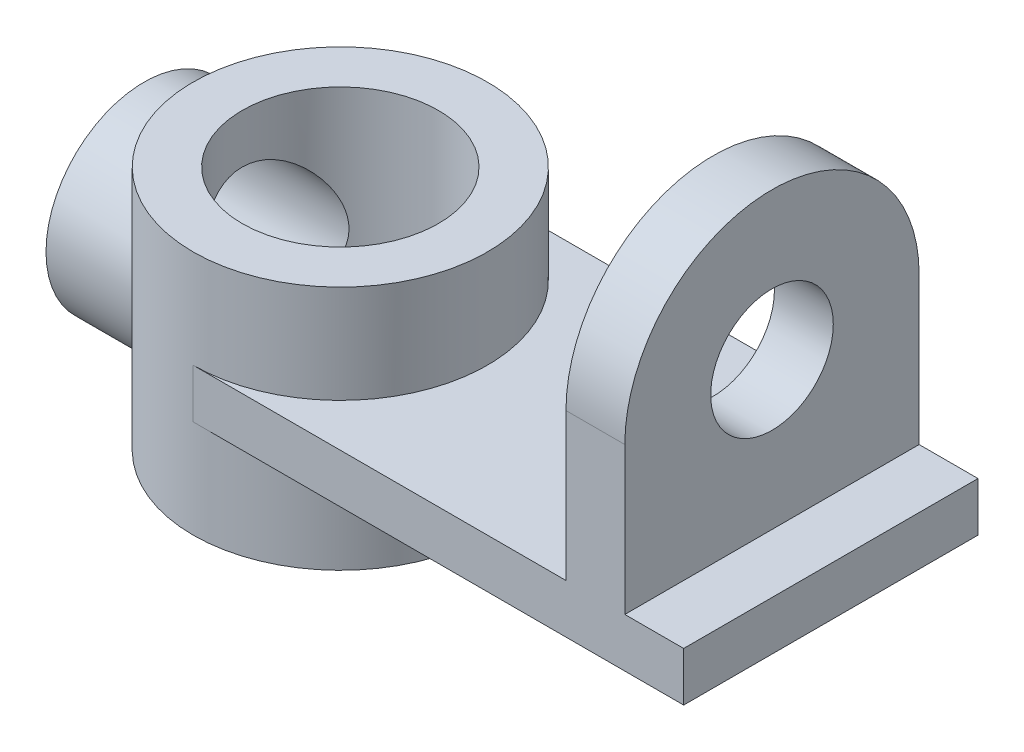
ISO-10303-21;
HEADER;
FILE_DESCRIPTION(('STEP AP214'),'2;1');
FILE_NAME('part.step','',(''),(''),'','','');
FILE_SCHEMA(('AUTOMOTIVE_DESIGN { 1 0 10303 214 1 1 1 1 }'));
ENDSEC;
DATA;
#1=APPLICATION_CONTEXT('core data for automotive mechanical design processes');
#2=APPLICATION_PROTOCOL_DEFINITION('international standard','automotive_design',2000,#1);
#3=PRODUCT_CONTEXT('',#1,'mechanical');
#4=PRODUCT('Part','Part','',(#3));
#5=PRODUCT_RELATED_PRODUCT_CATEGORY('part','',(#4));
#6=PRODUCT_DEFINITION_FORMATION('','',#4);
#7=PRODUCT_DEFINITION_CONTEXT('part definition',#1,'design');
#8=PRODUCT_DEFINITION('design','',#6,#7);
#9=PRODUCT_DEFINITION_SHAPE('','',#8);
#10=(LENGTH_UNIT() NAMED_UNIT(*) SI_UNIT(.MILLI.,.METRE.));
#11=(NAMED_UNIT(*) PLANE_ANGLE_UNIT() SI_UNIT($,.RADIAN.));
#12=(NAMED_UNIT(*) SI_UNIT($,.STERADIAN.) SOLID_ANGLE_UNIT());
#13=UNCERTAINTY_MEASURE_WITH_UNIT(LENGTH_MEASURE(1.E-05),#10,'distance_accuracy_value','');
#14=(GEOMETRIC_REPRESENTATION_CONTEXT(3) GLOBAL_UNCERTAINTY_ASSIGNED_CONTEXT((#13)) GLOBAL_UNIT_ASSIGNED_CONTEXT((#10,
#11,#12)) REPRESENTATION_CONTEXT('',''));
#15=CARTESIAN_POINT('',(0.,0.,0.));
#16=DIRECTION('',(0.,0.,1.));
#17=DIRECTION('',(1.,0.,0.));
#18=AXIS2_PLACEMENT_3D('',#15,#16,#17);
#19=CARTESIAN_POINT('',(0.,25.,-30.));
#20=DIRECTION('',(0.,-1.,0.));
#21=DIRECTION('',(0.,0.,-1.));
#22=AXIS2_PLACEMENT_3D('',#19,#20,#21);
#23=CYLINDRICAL_SURFACE('',#22,30.);
#24=DIRECTION('',(0.,-1.,0.));
#25=VECTOR('',#24,1.);
#26=CARTESIAN_POINT('',(0.,5.,0.));
#27=LINE('',#26,#25);
#28=CARTESIAN_POINT('',(0.,5.,0.));
#29=VERTEX_POINT('',#28);
#30=CARTESIAN_POINT('',(0.,-5.,0.));
#31=VERTEX_POINT('',#30);
#32=EDGE_CURVE('E167',#29,#31,#27,.T.);
#33=ORIENTED_EDGE('',*,*,#32,.F.);
#34=CARTESIAN_POINT('',(0.,5.,-30.));
#35=DIRECTION('',(0.,-1.,0.));
#36=DIRECTION('',(0.,0.,-1.));
#37=AXIS2_PLACEMENT_3D('',#34,#35,#36);
#38=CIRCLE('',#37,30.);
#39=CARTESIAN_POINT('',(0.,5.,-60.));
#40=VERTEX_POINT('',#39);
#41=EDGE_CURVE('E146',#29,#40,#38,.F.);
#42=ORIENTED_EDGE('',*,*,#41,.T.);
#43=DIRECTION('',(0.,-1.,0.));
#44=VECTOR('',#43,1.);
#45=CARTESIAN_POINT('',(0.,5.,-60.));
#46=LINE('',#45,#44);
#47=CARTESIAN_POINT('',(0.,-5.,-60.));
#48=VERTEX_POINT('',#47);
#49=EDGE_CURVE('E111',#40,#48,#46,.T.);
#50=ORIENTED_EDGE('',*,*,#49,.T.);
#51=CARTESIAN_POINT('',(0.,-5.,-30.));
#52=DIRECTION('',(0.,-1.,0.));
#53=DIRECTION('',(0.,0.,-1.));
#54=AXIS2_PLACEMENT_3D('',#51,#52,#53);
#55=CIRCLE('',#54,30.);
#56=EDGE_CURVE('E170',#31,#48,#55,.F.);
#57=ORIENTED_EDGE('',*,*,#56,.F.);
#58=EDGE_LOOP('',(#33,#42,#50,#57));
#59=FACE_BOUND('',#58,.T.);
#60=CARTESIAN_POINT('',(0.,25.,-30.));
#61=DIRECTION('',(0.,1.,0.));
#62=DIRECTION('',(0.,0.,1.));
#63=AXIS2_PLACEMENT_3D('',#60,#61,#62);
#64=CIRCLE('',#63,30.);
#65=CARTESIAN_POINT('',(0.,25.,0.));
#66=VERTEX_POINT('',#65);
#67=EDGE_CURVE('E143',#66,#66,#64,.T.);
#68=ORIENTED_EDGE('',*,*,#67,.F.);
#69=EDGE_LOOP('',(#68));
#70=FACE_BOUND('',#69,.T.);
#71=CARTESIAN_POINT('',(0.,-25.,-30.));
#72=DIRECTION('',(0.,1.,0.));
#73=DIRECTION('',(0.,0.,1.));
#74=AXIS2_PLACEMENT_3D('',#71,#72,#73);
#75=CIRCLE('',#74,30.);
#76=CARTESIAN_POINT('',(0.,-25.,0.));
#77=VERTEX_POINT('',#76);
#78=EDGE_CURVE('E140',#77,#77,#75,.T.);
#79=ORIENTED_EDGE('',*,*,#78,.T.);
#80=EDGE_LOOP('',(#79));
#81=FACE_BOUND('',#80,.T.);
#82=CARTESIAN_POINT('',(-22.3606797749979,0.,-10.));
#83=CARTESIAN_POINT('',(-22.3606858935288,0.488208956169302,-10.0000035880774));
#84=CARTESIAN_POINT('',(-22.3767415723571,0.976468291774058,-10.0179133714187));
#85=CARTESIAN_POINT('',(-22.4401594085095,1.94835881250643,-10.0891626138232));
#86=CARTESIAN_POINT('',(-22.4875265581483,2.43198924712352,-10.1425077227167));
#87=CARTESIAN_POINT('',(-22.6113496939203,3.39112332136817,-10.2836200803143));
#88=CARTESIAN_POINT('',(-22.6878496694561,3.8666135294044,-10.3714393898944));
#89=CARTESIAN_POINT('',(-22.8665434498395,4.80533737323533,-10.5799080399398));
#90=CARTESIAN_POINT('',(-22.9687377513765,5.26857077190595,-10.7005580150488));
#91=CARTESIAN_POINT('',(-23.193728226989,6.17578513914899,-10.9715573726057));
#92=CARTESIAN_POINT('',(-23.3163108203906,6.6199111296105,-11.1216014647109));
#93=CARTESIAN_POINT('',(-23.5787801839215,7.49212487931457,-11.4504619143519));
#94=CARTESIAN_POINT('',(-23.7186697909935,7.92020999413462,-11.6292829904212));
#95=CARTESIAN_POINT('',(-24.0118255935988,8.75912421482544,-12.0141521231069));
#96=CARTESIAN_POINT('',(-24.1650909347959,9.16995442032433,-12.2201984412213));
#97=CARTESIAN_POINT('',(-24.4813525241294,9.97362051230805,-12.6582477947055));
#98=CARTESIAN_POINT('',(-24.644349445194,10.3664551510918,-12.8902526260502));
#99=CARTESIAN_POINT('',(-25.00257367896,11.1932268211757,-13.4172388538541));
#100=CARTESIAN_POINT('',(-25.1988679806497,11.6240409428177,-13.7164014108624));
#101=CARTESIAN_POINT('',(-25.5951544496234,12.4598274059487,-14.3466719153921));
#102=CARTESIAN_POINT('',(-25.7951468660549,12.8647979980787,-14.6777820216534));
#103=CARTESIAN_POINT('',(-26.194621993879,13.6481434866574,-15.3711923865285));
#104=CARTESIAN_POINT('',(-26.3941040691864,14.0264936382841,-15.7335209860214));
#105=CARTESIAN_POINT('',(-26.7882586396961,14.7548145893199,-16.4881367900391));
#106=CARTESIAN_POINT('',(-26.9829308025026,15.1047834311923,-16.8804260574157));
#107=CARTESIAN_POINT('',(-27.3910931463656,15.8231340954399,-17.7528689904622));
#108=CARTESIAN_POINT('',(-27.6032288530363,16.1868495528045,-18.2375219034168));
#109=CARTESIAN_POINT('',(-28.0103500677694,16.8717372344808,-19.2429345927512));
#110=CARTESIAN_POINT('',(-28.2053335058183,17.1929043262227,-19.7636987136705));
#111=CARTESIAN_POINT('',(-28.5724511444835,17.7887598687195,-20.8382815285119));
#112=CARTESIAN_POINT('',(-28.7446044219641,18.0634871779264,-21.3920720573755));
#113=CARTESIAN_POINT('',(-29.0609568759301,18.5627727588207,-22.5294615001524));
#114=CARTESIAN_POINT('',(-29.205162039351,18.7873417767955,-23.1130539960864));
#115=CARTESIAN_POINT('',(-29.4464999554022,19.1602240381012,-24.2383416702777));
#116=CARTESIAN_POINT('',(-29.5470977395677,19.3142641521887,-24.7773977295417));
#117=CARTESIAN_POINT('',(-29.7196407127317,19.5772038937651,-25.8709332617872));
#118=CARTESIAN_POINT('',(-29.7915878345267,19.6861065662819,-26.4254116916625));
#119=CARTESIAN_POINT('',(-29.904587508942,19.8566974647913,-27.5441115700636));
#120=CARTESIAN_POINT('',(-29.9456724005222,19.9184351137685,-28.1083221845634));
#121=CARTESIAN_POINT('',(-29.9957633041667,19.9936647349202,-29.2413409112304));
#122=CARTESIAN_POINT('',(-30.0047738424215,20.007163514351,-29.8101483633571));
#123=CARTESIAN_POINT('',(-29.9915473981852,19.9873184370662,-30.8598064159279));
#124=CARTESIAN_POINT('',(-29.9738593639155,19.9607940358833,-31.3408623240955));
#125=CARTESIAN_POINT('',(-29.9156709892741,19.873310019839,-32.2983895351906));
#126=CARTESIAN_POINT('',(-29.8751735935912,19.8123548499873,-32.7748614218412));
#127=CARTESIAN_POINT('',(-29.7722764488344,19.6568520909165,-33.7198828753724));
#128=CARTESIAN_POINT('',(-29.7098757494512,19.5623030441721,-34.1884320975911));
#129=CARTESIAN_POINT('',(-29.5645234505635,19.3408382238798,-35.1145566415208));
#130=CARTESIAN_POINT('',(-29.4815709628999,19.2139210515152,-35.5721314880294));
#131=CARTESIAN_POINT('',(-29.2971987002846,18.9298040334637,-36.4717981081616));
#132=CARTESIAN_POINT('',(-29.1958554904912,18.7727295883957,-36.9139453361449));
#133=CARTESIAN_POINT('',(-28.9764235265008,18.4296096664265,-37.7825152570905));
#134=CARTESIAN_POINT('',(-28.858335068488,18.2435647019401,-38.2089382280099));
#135=CARTESIAN_POINT('',(-28.6075257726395,17.8441778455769,-39.0443176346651));
#136=CARTESIAN_POINT('',(-28.4748045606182,17.6308352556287,-39.4532736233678));
#137=CARTESIAN_POINT('',(-28.1969539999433,17.1784769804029,-40.2523545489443));
#138=CARTESIAN_POINT('',(-28.0518231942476,16.9394582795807,-40.6424772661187));
#139=CARTESIAN_POINT('',(-27.7317267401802,16.4042840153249,-41.4527356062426));
#140=CARTESIAN_POINT('',(-27.5553463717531,16.1047473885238,-41.8700812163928));
#141=CARTESIAN_POINT('',(-27.1930871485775,15.4767499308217,-42.6780149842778));
#142=CARTESIAN_POINT('',(-27.007207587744,15.1482869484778,-43.0686011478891));
#143=CARTESIAN_POINT('',(-26.6292105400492,14.463625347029,-43.8225619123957));
#144=CARTESIAN_POINT('',(-26.4370844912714,14.107387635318,-44.185896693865));
#145=CARTESIAN_POINT('',(-26.0505351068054,13.3689696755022,-44.883843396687));
#146=CARTESIAN_POINT('',(-25.8561116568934,12.9867881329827,-45.2184538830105));
#147=CARTESIAN_POINT('',(-25.4387487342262,12.1362208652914,-45.9077512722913));
#148=CARTESIAN_POINT('',(-25.2160728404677,11.6636681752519,-46.2574779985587));
#149=CARTESIAN_POINT('',(-24.7793365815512,10.6867448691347,-46.9156894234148));
#150=CARTESIAN_POINT('',(-24.5652781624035,10.1823671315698,-47.2241648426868));
#151=CARTESIAN_POINT('',(-24.1532936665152,9.14376134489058,-47.7972680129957));
#152=CARTESIAN_POINT('',(-23.9553464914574,8.60957393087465,-48.0619535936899));
#153=CARTESIAN_POINT('',(-23.6764424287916,7.78719238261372,-48.4241508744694));
#154=CARTESIAN_POINT('',(-23.586488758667,7.50958963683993,-48.539064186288));
#155=CARTESIAN_POINT('',(-23.4135888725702,6.9474950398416,-48.7569503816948));
#156=CARTESIAN_POINT('',(-23.3306443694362,6.66300152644,-48.8599203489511));
#157=CARTESIAN_POINT('',(-23.1390114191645,5.96407091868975,-49.0949737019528));
#158=CARTESIAN_POINT('',(-23.0345499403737,5.54626140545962,-49.2205883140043));
#159=CARTESIAN_POINT('',(-22.8454014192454,4.69922231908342,-49.4450303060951));
#160=CARTESIAN_POINT('',(-22.7607089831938,4.26999589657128,-49.5438649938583));
#161=CARTESIAN_POINT('',(-22.6140815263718,3.40278811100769,-49.7133430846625));
#162=CARTESIAN_POINT('',(-22.5521140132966,2.96482019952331,-49.78402675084));
#163=CARTESIAN_POINT('',(-22.4531500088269,2.08233638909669,-49.8962732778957));
#164=CARTESIAN_POINT('',(-22.4161536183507,1.6378204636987,-49.9378360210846));
#165=CARTESIAN_POINT('',(-22.3685666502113,0.743602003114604,-49.9912114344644));
#166=CARTESIAN_POINT('',(-22.3580932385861,0.293885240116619,-50.0028921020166));
#167=CARTESIAN_POINT('',(-22.3643493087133,-0.60512029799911,-49.9958970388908));
#168=CARTESIAN_POINT('',(-22.381078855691,-1.05440907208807,-49.9772212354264));
#169=CARTESIAN_POINT('',(-22.4410353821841,-1.94924286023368,-49.9098452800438));
#170=CARTESIAN_POINT('',(-22.4842812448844,-2.39478497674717,-49.8611237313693));
#171=CARTESIAN_POINT('',(-22.5954993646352,-3.2785403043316,-49.7344995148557));
#172=CARTESIAN_POINT('',(-22.6634720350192,-3.71675339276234,-49.6565963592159));
#173=CARTESIAN_POINT('',(-22.8176625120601,-4.56177482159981,-49.4773587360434));
#174=CARTESIAN_POINT('',(-22.9028156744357,-4.96906636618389,-49.3773687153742));
#175=CARTESIAN_POINT('',(-23.0905696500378,-5.77297690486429,-49.1532490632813));
#176=CARTESIAN_POINT('',(-23.193177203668,-6.16959170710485,-49.0291101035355));
#177=CARTESIAN_POINT('',(-23.4130553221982,-6.95065639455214,-48.7579126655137));
#178=CARTESIAN_POINT('',(-23.5303248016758,-7.33510717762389,-48.6108558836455));
#179=CARTESIAN_POINT('',(-23.7768089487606,-8.0910039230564,-48.2949037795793));
#180=CARTESIAN_POINT('',(-23.9060253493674,-8.46244798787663,-48.1260052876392));
#181=CARTESIAN_POINT('',(-24.2005356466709,-9.26453201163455,-47.731501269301));
#182=CARTESIAN_POINT('',(-24.3678787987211,-9.69216720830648,-47.5013086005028));
#183=CARTESIAN_POINT('',(-24.7117489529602,-10.5268797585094,-47.0123139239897));
#184=CARTESIAN_POINT('',(-24.8882768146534,-10.9339551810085,-46.7535092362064));
#185=CARTESIAN_POINT('',(-25.246838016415,-11.7272393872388,-46.2081390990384));
#186=CARTESIAN_POINT('',(-25.4288771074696,-12.1134251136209,-45.9215439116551));
#187=CARTESIAN_POINT('',(-25.7947122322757,-12.8636865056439,-45.3217576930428));
#188=CARTESIAN_POINT('',(-25.9785083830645,-13.2277606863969,-45.0085648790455));
#189=CARTESIAN_POINT('',(-26.3845748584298,-14.010022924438,-44.2850209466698));
#190=CARTESIAN_POINT('',(-26.6064699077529,-14.4226354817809,-43.868399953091));
#191=CARTESIAN_POINT('',(-27.0422910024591,-15.2116275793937,-42.9981303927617));
#192=CARTESIAN_POINT('',(-27.2562155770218,-15.5880004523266,-42.5444750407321));
#193=CARTESIAN_POINT('',(-27.6705120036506,-16.3015809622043,-41.6020484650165));
#194=CARTESIAN_POINT('',(-27.8708931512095,-16.6388155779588,-41.1133018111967));
#195=CARTESIAN_POINT('',(-28.2529916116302,-17.2712189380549,-40.1024838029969));
#196=CARTESIAN_POINT('',(-28.4347139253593,-17.5663989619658,-39.5804214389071));
#197=CARTESIAN_POINT('',(-28.7418292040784,-18.0588559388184,-38.6089869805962));
#198=CARTESIAN_POINT('',(-28.871337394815,-18.2640476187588,-38.1649131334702));
#199=CARTESIAN_POINT('',(-29.11237793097,-18.6427436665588,-37.2587296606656));
#200=CARTESIAN_POINT('',(-29.2239123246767,-18.8162516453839,-36.7966220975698));
#201=CARTESIAN_POINT('',(-29.4266077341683,-19.1295452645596,-35.8570926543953));
#202=CARTESIAN_POINT('',(-29.5177824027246,-19.2693535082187,-35.379681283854));
#203=CARTESIAN_POINT('',(-29.6778186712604,-19.5136219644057,-34.4121935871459));
#204=CARTESIAN_POINT('',(-29.746679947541,-19.6180816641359,-33.9221170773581));
#205=CARTESIAN_POINT('',(-29.8607111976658,-19.7905605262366,-32.9305412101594));
#206=CARTESIAN_POINT('',(-29.9057729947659,-19.8584133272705,-32.429000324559));
#207=CARTESIAN_POINT('',(-29.9706058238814,-19.9559150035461,-31.420578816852));
#208=CARTESIAN_POINT('',(-29.990376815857,-19.985563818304,-30.913698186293));
#209=CARTESIAN_POINT('',(-30.0041212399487,-20.0061827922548,-29.8988306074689));
#210=CARTESIAN_POINT('',(-29.9980962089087,-19.9971552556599,-29.3908437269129));
#211=CARTESIAN_POINT('',(-29.9604056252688,-19.9405705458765,-28.3780001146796));
#212=CARTESIAN_POINT('',(-29.9287412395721,-19.8930151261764,-27.8731432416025));
#213=CARTESIAN_POINT('',(-29.8437985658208,-19.7649794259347,-26.907200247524));
#214=CARTESIAN_POINT('',(-29.7922629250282,-19.687150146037,-26.4456047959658));
#215=CARTESIAN_POINT('',(-29.6689450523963,-19.5000321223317,-25.5316309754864));
#216=CARTESIAN_POINT('',(-29.597163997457,-19.3907452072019,-25.0792520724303));
#217=CARTESIAN_POINT('',(-29.4347944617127,-19.1419956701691,-24.1863229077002));
#218=CARTESIAN_POINT('',(-29.344204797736,-19.0025311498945,-23.745773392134));
#219=CARTESIAN_POINT('',(-29.1459419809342,-18.6949126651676,-22.8787740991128));
#220=CARTESIAN_POINT('',(-29.0382679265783,-18.5267571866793,-22.4523250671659));
#221=CARTESIAN_POINT('',(-28.8010951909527,-18.1528283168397,-21.5912122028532));
#222=CARTESIAN_POINT('',(-28.670694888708,-17.9454426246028,-21.157497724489));
#223=CARTESIAN_POINT('',(-28.3953682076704,-17.5022026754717,-20.3097085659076));
#224=CARTESIAN_POINT('',(-28.2504414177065,-17.2663476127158,-19.895634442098));
#225=CARTESIAN_POINT('',(-27.9485407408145,-16.7678351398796,-19.0883144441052));
#226=CARTESIAN_POINT('',(-27.7915617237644,-16.5051663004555,-18.6950775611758));
#227=CARTESIAN_POINT('',(-27.4682178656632,-15.9547049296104,-17.9306468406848));
#228=CARTESIAN_POINT('',(-27.3018519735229,-15.6669095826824,-17.5594554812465));
#229=CARTESIAN_POINT('',(-26.9357159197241,-15.0204704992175,-16.7833792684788));
#230=CARTESIAN_POINT('',(-26.7348072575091,-14.6578028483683,-16.3823769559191));
#231=CARTESIAN_POINT('',(-26.3282976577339,-13.9025385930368,-15.6121432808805));
#232=CARTESIAN_POINT('',(-26.1226961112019,-13.5099380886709,-15.242916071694));
#233=CARTESIAN_POINT('',(-25.7111873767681,-12.6960054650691,-14.5370818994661));
#234=CARTESIAN_POINT('',(-25.5052800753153,-12.2746525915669,-14.2004989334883));
#235=CARTESIAN_POINT('',(-25.0981854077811,-11.4046784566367,-13.5614911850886));
#236=CARTESIAN_POINT('',(-24.8969975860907,-10.9560598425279,-13.2590630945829));
#237=CARTESIAN_POINT('',(-24.519622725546,-10.067816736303,-12.711562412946));
#238=CARTESIAN_POINT('',(-24.3426994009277,-9.63011792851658,-12.463874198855));
#239=CARTESIAN_POINT('',(-24.0019984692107,-8.7331555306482,-12.0003665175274));
#240=CARTESIAN_POINT('',(-23.838221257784,-8.27389129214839,-11.7845480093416));
#241=CARTESIAN_POINT('',(-23.5290813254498,-7.33576452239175,-11.3869488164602));
#242=CARTESIAN_POINT('',(-23.3836894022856,-6.8569347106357,-11.2051139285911));
#243=CARTESIAN_POINT('',(-23.1163199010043,-5.88083845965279,-10.8772235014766));
#244=CARTESIAN_POINT('',(-22.9943359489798,-5.38357708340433,-10.731158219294));
#245=CARTESIAN_POINT('',(-22.802875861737,-4.48539119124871,-10.5052407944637));
#246=CARTESIAN_POINT('',(-22.7277543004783,-4.08754467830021,-10.4178884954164));
#247=CARTESIAN_POINT('',(-22.5970955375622,-3.28415884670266,-10.2672544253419));
#248=CARTESIAN_POINT('',(-22.541555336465,-2.87862071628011,-10.2039689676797));
#249=CARTESIAN_POINT('',(-22.4519236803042,-2.06234621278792,-10.1023684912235));
#250=CARTESIAN_POINT('',(-22.4178171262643,-1.65161370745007,-10.0640358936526));
#251=CARTESIAN_POINT('',(-22.3721912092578,-0.827266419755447,-10.0128485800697));
#252=CARTESIAN_POINT('',(-22.3606745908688,-0.413651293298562,-9.99999695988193));
#253=CARTESIAN_POINT('',(-22.3606797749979,0.,-10.));
#254=B_SPLINE_CURVE_WITH_KNOTS('',3,(#82,#83,#84,#85,#86,#87,#88,#89,#90,#91,#92,#93,#94,#95,
#96,#97,#98,#99,#100,#101,#102,#103,#104,#105,#106,#107,#108,#109,#110,#111,#112,#113,#114,#115,
#116,#117,#118,#119,#120,#121,#122,#123,#124,#125,#126,#127,#128,#129,#130,#131,#132,#133,#134,
#135,#136,#137,#138,#139,#140,#141,#142,#143,#144,#145,#146,#147,#148,#149,#150,#151,#152,#153,
#154,#155,#156,#157,#158,#159,#160,#161,#162,#163,#164,#165,#166,#167,#168,#169,#170,#171,#172,
#173,#174,#175,#176,#177,#178,#179,#180,#181,#182,#183,#184,#185,#186,#187,#188,#189,#190,#191,
#192,#193,#194,#195,#196,#197,#198,#199,#200,#201,#202,#203,#204,#205,#206,#207,#208,#209,#210,
#211,#212,#213,#214,#215,#216,#217,#218,#219,#220,#221,#222,#223,#224,#225,#226,#227,#228,#229,
#230,#231,#232,#233,#234,#235,#236,#237,#238,#239,#240,#241,#242,#243,#244,#245,#246,#247,#248,
#249,#250,#251,#252,#253),.UNSPECIFIED.,.T.,.F.,(4,2,2,2,2,2,2,2,2,2,2,2,2,2,2,2,2,2,2,2,2,2,2,
2,2,2,2,2,2,2,2,2,2,2,2,2,2,2,2,2,2,2,2,2,2,2,2,2,2,2,2,2,2,2,2,2,2,2,2,2,2,2,2,2,2,2,2,2,2,2,2,
2,2,2,2,2,2,2,2,2,2,2,2,2,2,4),(0.,1.46413383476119,2.92850116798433,4.3950884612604,
5.86170410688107,7.31382579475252,8.76618582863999,10.2184531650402,11.6708210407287,
13.3493094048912,15.0279112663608,16.7080533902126,18.3883112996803,20.3117642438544,
22.2354490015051,24.1575160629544,26.079170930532,27.7853619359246,29.4914378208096,
31.1957234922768,32.8997686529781,34.3443503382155,35.7887455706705,37.2332034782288,
38.6777238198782,40.1163627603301,41.5549762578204,42.9936265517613,44.4324459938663,
46.0602839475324,47.6882430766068,49.3185364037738,50.9489111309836,52.8326361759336,
54.7167842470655,56.5984238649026,57.5389749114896,58.4797551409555,59.8242529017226,
61.1683834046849,62.5105844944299,63.8527910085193,65.2009164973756,66.5490452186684,
67.8981351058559,69.2472475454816,70.529851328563,71.8129515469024,73.0959568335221,
74.3791485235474,75.9187799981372,77.4585558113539,78.999997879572,80.5415433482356,
82.4201756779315,84.2991529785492,86.1768272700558,88.053996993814,89.5706110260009,
91.0870521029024,92.6024732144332,94.1179163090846,95.6401895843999,97.1624652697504,
98.6846502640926,100.206765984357,101.617993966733,103.029139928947,104.440374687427,
105.851683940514,107.344548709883,108.837455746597,110.331001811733,111.824715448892,
113.553354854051,115.282219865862,117.012346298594,118.742305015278,120.340261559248,
121.93826618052,123.53369984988,125.128698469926,126.370149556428,127.611410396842,
128.851795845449,130.092331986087),.UNSPECIFIED.);
#255=CARTESIAN_POINT('',(-22.3606797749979,0.,-10.));
#256=VERTEX_POINT('',#255);
#257=EDGE_CURVE('E11',#256,#256,#254,.T.);
#258=ORIENTED_EDGE('',*,*,#257,.F.);
#259=EDGE_LOOP('',(#258));
#260=FACE_BOUND('',#259,.T.);
#261=ADVANCED_FACE('F31',(#59,#70,#81,#260),#23,.T.);
#262=CARTESIAN_POINT('',(88.,35.,-30.));
#263=DIRECTION('',(1.,0.,0.));
#264=DIRECTION('',(0.,0.,-1.));
#265=AXIS2_PLACEMENT_3D('',#262,#263,#264);
#266=CYLINDRICAL_SURFACE('',#265,30.);
#267=DIRECTION('',(-1.,0.,0.));
#268=VECTOR('',#267,1.);
#269=CARTESIAN_POINT('',(88.,35.,0.));
#270=LINE('',#269,#268);
#271=CARTESIAN_POINT('',(88.,35.,0.));
#272=VERTEX_POINT('',#271);
#273=CARTESIAN_POINT('',(76.,35.,0.));
#274=VERTEX_POINT('',#273);
#275=EDGE_CURVE('E173',#272,#274,#270,.T.);
#276=ORIENTED_EDGE('',*,*,#275,.F.);
#277=CARTESIAN_POINT('',(88.,35.,-30.));
#278=DIRECTION('',(-1.,0.,0.));
#279=DIRECTION('',(0.,0.,1.));
#280=AXIS2_PLACEMENT_3D('',#277,#278,#279);
#281=CIRCLE('',#280,30.);
#282=CARTESIAN_POINT('',(88.,35.,-60.));
#283=VERTEX_POINT('',#282);
#284=EDGE_CURVE('E50',#283,#272,#281,.F.);
#285=ORIENTED_EDGE('',*,*,#284,.F.);
#286=DIRECTION('',(-1.,0.,0.));
#287=VECTOR('',#286,1.);
#288=CARTESIAN_POINT('',(88.,35.,-60.));
#289=LINE('',#288,#287);
#290=CARTESIAN_POINT('',(76.,35.,-60.));
#291=VERTEX_POINT('',#290);
#292=EDGE_CURVE('E176',#291,#283,#289,.F.);
#293=ORIENTED_EDGE('',*,*,#292,.F.);
#294=CARTESIAN_POINT('',(76.,35.,-30.));
#295=DIRECTION('',(1.,0.,0.));
#296=DIRECTION('',(0.,0.,-1.));
#297=AXIS2_PLACEMENT_3D('',#294,#295,#296);
#298=CIRCLE('',#297,30.);
#299=EDGE_CURVE('E43',#274,#291,#298,.F.);
#300=ORIENTED_EDGE('',*,*,#299,.F.);
#301=EDGE_LOOP('',(#276,#285,#293,#300));
#302=FACE_BOUND('',#301,.T.);
#303=ADVANCED_FACE('F33',(#302),#266,.T.);
#304=CARTESIAN_POINT('',(0.,5.,-60.));
#305=DIRECTION('',(0.,-1.,0.));
#306=DIRECTION('',(0.,0.,-1.));
#307=AXIS2_PLACEMENT_3D('',#304,#305,#306);
#308=PLANE('',#307);
#309=DIRECTION('',(0.,0.,1.));
#310=VECTOR('',#309,1.);
#311=CARTESIAN_POINT('',(76.,5.,-60.));
#312=LINE('',#311,#310);
#313=CARTESIAN_POINT('',(76.,5.,-60.));
#314=VERTEX_POINT('',#313);
#315=CARTESIAN_POINT('',(76.,5.,0.));
#316=VERTEX_POINT('',#315);
#317=EDGE_CURVE('E102',#314,#316,#312,.T.);
#318=ORIENTED_EDGE('',*,*,#317,.F.);
#319=DIRECTION('',(-1.,0.,0.));
#320=VECTOR('',#319,1.);
#321=CARTESIAN_POINT('',(0.,5.,-60.));
#322=LINE('',#321,#320);
#323=EDGE_CURVE('E108',#314,#40,#322,.T.);
#324=ORIENTED_EDGE('',*,*,#323,.T.);
#325=ORIENTED_EDGE('',*,*,#41,.F.);
#326=DIRECTION('',(1.,0.,0.));
#327=VECTOR('',#326,1.);
#328=CARTESIAN_POINT('',(0.,5.,0.));
#329=LINE('',#328,#327);
#330=EDGE_CURVE('E121',#29,#316,#329,.T.);
#331=ORIENTED_EDGE('',*,*,#330,.T.);
#332=EDGE_LOOP('',(#318,#324,#325,#331));
#333=FACE_BOUND('',#332,.T.);
#334=ADVANCED_FACE('F119',(#333),#308,.F.);
#335=DIRECTION('',(0.,0.,-1.));
#336=VECTOR('',#335,1.);
#337=CARTESIAN_POINT('',(88.,5.,-60.));
#338=LINE('',#337,#336);
#339=CARTESIAN_POINT('',(88.,5.,0.));
#340=VERTEX_POINT('',#339);
#341=CARTESIAN_POINT('',(88.,5.,-60.));
#342=VERTEX_POINT('',#341);
#343=EDGE_CURVE('E105',#340,#342,#338,.T.);
#344=ORIENTED_EDGE('',*,*,#343,.F.);
#345=CARTESIAN_POINT('',(100.,5.,0.));
#346=VERTEX_POINT('',#345);
#347=EDGE_CURVE('E152',#340,#346,#329,.T.);
#348=ORIENTED_EDGE('',*,*,#347,.T.);
#349=DIRECTION('',(0.,0.,-1.));
#350=VECTOR('',#349,1.);
#351=CARTESIAN_POINT('',(100.,5.,0.));
#352=LINE('',#351,#350);
#353=CARTESIAN_POINT('',(100.,5.,-60.));
#354=VERTEX_POINT('',#353);
#355=EDGE_CURVE('E116',#346,#354,#352,.T.);
#356=ORIENTED_EDGE('',*,*,#355,.T.);
#357=EDGE_CURVE('E115',#354,#342,#322,.T.);
#358=ORIENTED_EDGE('',*,*,#357,.T.);
#359=EDGE_LOOP('',(#344,#348,#356,#358));
#360=FACE_BOUND('',#359,.T.);
#361=ADVANCED_FACE('F189',(#360),#308,.F.);
#362=CARTESIAN_POINT('',(0.,-5.,-60.));
#363=DIRECTION('',(0.,-1.,0.));
#364=DIRECTION('',(0.,0.,-1.));
#365=AXIS2_PLACEMENT_3D('',#362,#363,#364);
#366=PLANE('',#365);
#367=DIRECTION('',(1.,0.,0.));
#368=VECTOR('',#367,1.);
#369=CARTESIAN_POINT('',(0.,-5.,0.));
#370=LINE('',#369,#368);
#371=CARTESIAN_POINT('',(100.,-5.,0.));
#372=VERTEX_POINT('',#371);
#373=EDGE_CURVE('E150',#31,#372,#370,.T.);
#374=ORIENTED_EDGE('',*,*,#373,.F.);
#375=ORIENTED_EDGE('',*,*,#56,.T.);
#376=DIRECTION('',(-1.,0.,0.));
#377=VECTOR('',#376,1.);
#378=CARTESIAN_POINT('',(0.,-5.,-60.));
#379=LINE('',#378,#377);
#380=CARTESIAN_POINT('',(100.,-5.,-60.));
#381=VERTEX_POINT('',#380);
#382=EDGE_CURVE('E158',#381,#48,#379,.T.);
#383=ORIENTED_EDGE('',*,*,#382,.F.);
#384=DIRECTION('',(0.,0.,-1.));
#385=VECTOR('',#384,1.);
#386=CARTESIAN_POINT('',(100.,-5.,0.));
#387=LINE('',#386,#385);
#388=EDGE_CURVE('E156',#372,#381,#387,.T.);
#389=ORIENTED_EDGE('',*,*,#388,.F.);
#390=EDGE_LOOP('',(#374,#375,#383,#389));
#391=FACE_BOUND('',#390,.T.);
#392=ADVANCED_FACE('F197',(#391),#366,.T.);
#393=CARTESIAN_POINT('',(0.,5.,0.));
#394=DIRECTION('',(0.,0.,-1.));
#395=DIRECTION('',(-1.,0.,0.));
#396=AXIS2_PLACEMENT_3D('',#393,#394,#395);
#397=PLANE('',#396);
#398=DIRECTION('',(0.,-1.,0.));
#399=VECTOR('',#398,1.);
#400=CARTESIAN_POINT('',(88.,65.,0.));
#401=LINE('',#400,#399);
#402=EDGE_CURVE('E132',#272,#340,#401,.T.);
#403=ORIENTED_EDGE('',*,*,#402,.F.);
#404=ORIENTED_EDGE('',*,*,#275,.T.);
#405=DIRECTION('',(0.,-1.,0.));
#406=VECTOR('',#405,1.);
#407=CARTESIAN_POINT('',(76.,65.,0.));
#408=LINE('',#407,#406);
#409=EDGE_CURVE('E134',#274,#316,#408,.T.);
#410=ORIENTED_EDGE('',*,*,#409,.T.);
#411=ORIENTED_EDGE('',*,*,#330,.F.);
#412=ORIENTED_EDGE('',*,*,#32,.T.);
#413=ORIENTED_EDGE('',*,*,#373,.T.);
#414=DIRECTION('',(0.,-1.,0.));
#415=VECTOR('',#414,1.);
#416=CARTESIAN_POINT('',(100.,5.,0.));
#417=LINE('',#416,#415);
#418=EDGE_CURVE('E164',#346,#372,#417,.T.);
#419=ORIENTED_EDGE('',*,*,#418,.F.);
#420=ORIENTED_EDGE('',*,*,#347,.F.);
#421=EDGE_LOOP('',(#403,#404,#410,#411,#412,#413,#419,#420));
#422=FACE_BOUND('',#421,.T.);
#423=ADVANCED_FACE('F185',(#422),#397,.F.);
#424=CARTESIAN_POINT('',(100.,5.,0.));
#425=DIRECTION('',(-1.,0.,0.));
#426=DIRECTION('',(0.,0.,1.));
#427=AXIS2_PLACEMENT_3D('',#424,#425,#426);
#428=PLANE('',#427);
#429=ORIENTED_EDGE('',*,*,#388,.T.);
#430=DIRECTION('',(0.,-1.,0.));
#431=VECTOR('',#430,1.);
#432=CARTESIAN_POINT('',(100.,5.,-60.));
#433=LINE('',#432,#431);
#434=EDGE_CURVE('E161',#354,#381,#433,.T.);
#435=ORIENTED_EDGE('',*,*,#434,.F.);
#436=ORIENTED_EDGE('',*,*,#355,.F.);
#437=ORIENTED_EDGE('',*,*,#418,.T.);
#438=EDGE_LOOP('',(#429,#435,#436,#437));
#439=FACE_BOUND('',#438,.T.);
#440=ADVANCED_FACE('F200',(#439),#428,.F.);
#441=CARTESIAN_POINT('',(0.,5.,-60.));
#442=DIRECTION('',(0.,0.,1.));
#443=DIRECTION('',(1.,0.,0.));
#444=AXIS2_PLACEMENT_3D('',#441,#442,#443);
#445=PLANE('',#444);
#446=DIRECTION('',(0.,-1.,0.));
#447=VECTOR('',#446,1.);
#448=CARTESIAN_POINT('',(76.,65.,-60.));
#449=LINE('',#448,#447);
#450=EDGE_CURVE('E98',#291,#314,#449,.T.);
#451=ORIENTED_EDGE('',*,*,#450,.F.);
#452=ORIENTED_EDGE('',*,*,#292,.T.);
#453=DIRECTION('',(0.,-1.,0.));
#454=VECTOR('',#453,1.);
#455=CARTESIAN_POINT('',(88.,65.,-60.));
#456=LINE('',#455,#454);
#457=EDGE_CURVE('E104',#283,#342,#456,.T.);
#458=ORIENTED_EDGE('',*,*,#457,.T.);
#459=ORIENTED_EDGE('',*,*,#357,.F.);
#460=ORIENTED_EDGE('',*,*,#434,.T.);
#461=ORIENTED_EDGE('',*,*,#382,.T.);
#462=ORIENTED_EDGE('',*,*,#49,.F.);
#463=ORIENTED_EDGE('',*,*,#323,.F.);
#464=EDGE_LOOP('',(#451,#452,#458,#459,#460,#461,#462,#463));
#465=FACE_BOUND('',#464,.T.);
#466=ADVANCED_FACE('F109',(#465),#445,.F.);
#467=CARTESIAN_POINT('',(0.,25.,-30.));
#468=DIRECTION('',(0.,1.,0.));
#469=DIRECTION('',(0.,0.,1.));
#470=AXIS2_PLACEMENT_3D('',#467,#468,#469);
#471=PLANE('',#470);
#472=CARTESIAN_POINT('',(0.,25.,-30.));
#473=DIRECTION('',(0.,1.,0.));
#474=DIRECTION('',(0.,0.,1.));
#475=AXIS2_PLACEMENT_3D('',#472,#473,#474);
#476=CIRCLE('',#475,20.);
#477=CARTESIAN_POINT('',(0.,25.,-9.99999999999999));
#478=VERTEX_POINT('',#477);
#479=EDGE_CURVE('E136',#478,#478,#476,.T.);
#480=ORIENTED_EDGE('',*,*,#479,.F.);
#481=EDGE_LOOP('',(#480));
#482=FACE_BOUND('',#481,.T.);
#483=ORIENTED_EDGE('',*,*,#67,.T.);
#484=EDGE_LOOP('',(#483));
#485=FACE_BOUND('',#484,.T.);
#486=ADVANCED_FACE('F207',(#482,#485),#471,.T.);
#487=CARTESIAN_POINT('',(0.,-25.,-30.));
#488=DIRECTION('',(0.,1.,0.));
#489=DIRECTION('',(0.,0.,1.));
#490=AXIS2_PLACEMENT_3D('',#487,#488,#489);
#491=PLANE('',#490);
#492=CARTESIAN_POINT('',(0.,-25.,-30.));
#493=DIRECTION('',(0.,1.,0.));
#494=DIRECTION('',(0.,0.,1.));
#495=AXIS2_PLACEMENT_3D('',#492,#493,#494);
#496=CIRCLE('',#495,20.);
#497=CARTESIAN_POINT('',(0.,-25.,-9.99999999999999));
#498=VERTEX_POINT('',#497);
#499=EDGE_CURVE('E137',#498,#498,#496,.T.);
#500=ORIENTED_EDGE('',*,*,#499,.T.);
#501=EDGE_LOOP('',(#500));
#502=FACE_BOUND('',#501,.T.);
#503=ORIENTED_EDGE('',*,*,#78,.F.);
#504=EDGE_LOOP('',(#503));
#505=FACE_BOUND('',#504,.T.);
#506=ADVANCED_FACE('F216',(#502,#505),#491,.F.);
#507=CARTESIAN_POINT('',(0.,-25.,-30.));
#508=DIRECTION('',(0.,1.,0.));
#509=DIRECTION('',(0.,0.,1.));
#510=AXIS2_PLACEMENT_3D('',#507,#508,#509);
#511=CYLINDRICAL_SURFACE('',#510,20.);
#512=CARTESIAN_POINT('',(-13.228756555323,0.,-15.));
#513=CARTESIAN_POINT('',(-13.228766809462,-0.35007989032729,-15.0000049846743));
#514=CARTESIAN_POINT('',(-13.2427343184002,-0.700236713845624,-15.0122915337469));
#515=CARTESIAN_POINT('',(-13.2977503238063,-1.39674329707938,-15.0610869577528));
#516=CARTESIAN_POINT('',(-13.3388078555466,-1.74309174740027,-15.0976039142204));
#517=CARTESIAN_POINT('',(-13.4456917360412,-2.42936786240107,-15.1939699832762));
#518=CARTESIAN_POINT('',(-13.5115720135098,-2.76927984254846,-15.2538699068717));
#519=CARTESIAN_POINT('',(-13.6647324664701,-3.4397076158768,-15.3956875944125));
#520=CARTESIAN_POINT('',(-13.7520267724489,-3.77021704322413,-15.4776199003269));
#521=CARTESIAN_POINT('',(-13.9428350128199,-4.41546480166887,-15.6607336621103));
#522=CARTESIAN_POINT('',(-14.0460993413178,-4.7303610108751,-15.7616233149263));
#523=CARTESIAN_POINT('',(-14.2661400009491,-5.34847307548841,-15.9821012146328));
#524=CARTESIAN_POINT('',(-14.3829116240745,-5.6516929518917,-16.1016829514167));
#525=CARTESIAN_POINT('',(-14.6267269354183,-6.24616943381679,-16.3585118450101));
#526=CARTESIAN_POINT('',(-14.7537688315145,-6.5374281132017,-16.4957559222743));
#527=CARTESIAN_POINT('',(-15.0152639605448,-7.10791224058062,-16.7871206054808));
#528=CARTESIAN_POINT('',(-15.1497177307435,-7.38713681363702,-16.9412424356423));
#529=CARTESIAN_POINT('',(-15.4521775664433,-7.99071956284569,-17.2997597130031));
#530=CARTESIAN_POINT('',(-15.6213119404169,-8.31227897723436,-17.5079232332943));
#531=CARTESIAN_POINT('',(-15.9627612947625,-8.93746542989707,-17.9472948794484));
#532=CARTESIAN_POINT('',(-16.13507653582,-9.24109098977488,-18.1785049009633));
#533=CARTESIAN_POINT('',(-16.4796612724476,-9.83038305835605,-18.663799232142));
#534=CARTESIAN_POINT('',(-16.6519303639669,-10.1160237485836,-18.9179152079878));
#535=CARTESIAN_POINT('',(-16.9930078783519,-10.6681497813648,-19.4483580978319));
#536=CARTESIAN_POINT('',(-17.1618160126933,-10.934633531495,-19.7246868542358));
#537=CARTESIAN_POINT('',(-17.5268619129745,-11.4998486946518,-20.3579788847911));
#538=CARTESIAN_POINT('',(-17.7216481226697,-11.7940279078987,-20.7198747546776));
#539=CARTESIAN_POINT('',(-18.0968011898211,-12.3505638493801,-21.4745449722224));
#540=CARTESIAN_POINT('',(-18.2771648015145,-12.6129134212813,-21.8673262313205));
#541=CARTESIAN_POINT('',(-18.6180919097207,-13.1020621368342,-22.6814591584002));
#542=CARTESIAN_POINT('',(-18.7786925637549,-13.3289282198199,-23.1027548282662));
#543=CARTESIAN_POINT('',(-19.0755036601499,-13.7439395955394,-23.9720825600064));
#544=CARTESIAN_POINT('',(-19.2117269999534,-13.9321053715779,-24.4201003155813));
#545=CARTESIAN_POINT('',(-19.4184117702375,-14.2155206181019,-25.2004576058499));
#546=CARTESIAN_POINT('',(-19.4963138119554,-14.3216751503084,-25.5269144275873));
#547=CARTESIAN_POINT('',(-19.6365467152,-14.5119991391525,-26.1894132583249));
#548=CARTESIAN_POINT('',(-19.6988812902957,-14.5961738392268,-26.5254529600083));
#549=CARTESIAN_POINT('',(-19.8067111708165,-14.7413760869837,-27.2049246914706));
#550=CARTESIAN_POINT('',(-19.8522177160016,-14.8024190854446,-27.54835162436));
#551=CARTESIAN_POINT('',(-19.9254938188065,-14.9005493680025,-28.240512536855));
#552=CARTESIAN_POINT('',(-19.9532627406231,-14.9376357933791,-28.5892467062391));
#553=CARTESIAN_POINT('',(-19.9904967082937,-14.9873357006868,-29.2903566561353));
#554=CARTESIAN_POINT('',(-19.9999135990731,-14.9998847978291,-29.6427395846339));
#555=CARTESIAN_POINT('',(-20.0000852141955,-15.0001136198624,-30.347516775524));
#556=CARTESIAN_POINT('',(-19.9908400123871,-14.9877934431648,-30.6999110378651));
#557=CARTESIAN_POINT('',(-19.9538935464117,-14.9384782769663,-31.4020549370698));
#558=CARTESIAN_POINT('',(-19.926188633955,-14.901478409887,-31.7518040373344));
#559=CARTESIAN_POINT('',(-19.8529325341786,-14.8033777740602,-32.4459952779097));
#560=CARTESIAN_POINT('',(-19.8073814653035,-14.7422771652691,-32.7904374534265));
#561=CARTESIAN_POINT('',(-19.7012609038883,-14.5993796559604,-33.4599478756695));
#562=CARTESIAN_POINT('',(-19.6412616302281,-14.5183665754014,-33.7852750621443));
#563=CARTESIAN_POINT('',(-19.506651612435,-14.3357338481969,-34.4269651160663));
#564=CARTESIAN_POINT('',(-19.4320413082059,-14.2341148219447,-34.7433282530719));
#565=CARTESIAN_POINT('',(-19.2695036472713,-14.0114083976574,-35.3655993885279));
#566=CARTESIAN_POINT('',(-19.1815756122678,-13.8903200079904,-35.6715068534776));
#567=CARTESIAN_POINT('',(-18.9938132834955,-13.6298601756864,-36.2716787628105));
#568=CARTESIAN_POINT('',(-18.8939773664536,-13.4904862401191,-36.5659416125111));
#569=CARTESIAN_POINT('',(-18.672520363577,-13.1786322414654,-37.1730301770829));
#570=CARTESIAN_POINT('',(-18.5497109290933,-13.0042018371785,-37.4844202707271));
#571=CARTESIAN_POINT('',(-18.2933673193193,-12.6358530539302,-38.0908031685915));
#572=CARTESIAN_POINT('',(-18.1598324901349,-12.4419334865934,-38.3857949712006));
#573=CARTESIAN_POINT('',(-17.8840361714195,-12.0358210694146,-38.9589313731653));
#574=CARTESIAN_POINT('',(-17.7417689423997,-11.8236161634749,-39.2370646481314));
#575=CARTESIAN_POINT('',(-17.4506880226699,-11.3821811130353,-39.775851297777));
#576=CARTESIAN_POINT('',(-17.3018736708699,-11.1529492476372,-40.0365029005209));
#577=CARTESIAN_POINT('',(-16.9701205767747,-10.6316991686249,-40.5895421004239));
#578=CARTESIAN_POINT('',(-16.7862279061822,-10.3362007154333,-40.878085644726));
#579=CARTESIAN_POINT('',(-16.4159365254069,-9.7233038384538,-41.4292287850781));
#580=CARTESIAN_POINT('',(-16.2295373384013,-9.40590119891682,-41.6918233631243));
#581=CARTESIAN_POINT('',(-15.8583023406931,-8.7497991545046,-42.1906083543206));
#582=CARTESIAN_POINT('',(-15.6734674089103,-8.41108857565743,-42.4267847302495));
#583=CARTESIAN_POINT('',(-15.3101499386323,-7.71294764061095,-42.8717420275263));
#584=CARTESIAN_POINT('',(-15.1316659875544,-7.35352193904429,-43.0805290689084));
#585=CARTESIAN_POINT('',(-14.8205031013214,-6.6870129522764,-43.4311696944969));
#586=CARTESIAN_POINT('',(-14.6857297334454,-6.38357579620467,-43.5781048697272));
#587=CARTESIAN_POINT('',(-14.4270297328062,-5.7635540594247,-43.8526668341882));
#588=CARTESIAN_POINT('',(-14.3031029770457,-5.44696962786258,-43.9802938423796));
#589=CARTESIAN_POINT('',(-14.0700166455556,-4.80163600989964,-44.2148490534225));
#590=CARTESIAN_POINT('',(-13.9608300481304,-4.47291052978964,-44.3218152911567));
#591=CARTESIAN_POINT('',(-13.7610209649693,-3.80362399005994,-44.5139086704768));
#592=CARTESIAN_POINT('',(-13.6703936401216,-3.46306604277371,-44.5990415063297));
#593=CARTESIAN_POINT('',(-13.5275389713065,-2.84026434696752,-44.7313679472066));
#594=CARTESIAN_POINT('',(-13.4712610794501,-2.55983497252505,-44.7827364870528));
#595=CARTESIAN_POINT('',(-13.3752461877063,-1.99372983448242,-44.8696672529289));
#596=CARTESIAN_POINT('',(-13.3355070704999,-1.70805474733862,-44.9052315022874));
#597=CARTESIAN_POINT('',(-13.2741604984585,-1.13349558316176,-44.959891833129));
#598=CARTESIAN_POINT('',(-13.2525333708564,-0.84461533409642,-44.9790057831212));
#599=CARTESIAN_POINT('',(-13.2282555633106,-0.265421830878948,-45.0004508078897));
#600=CARTESIAN_POINT('',(-13.2256050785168,0.0248914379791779,-45.0027817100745));
#601=CARTESIAN_POINT('',(-13.2394003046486,0.604798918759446,-44.9906090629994));
#602=CARTESIAN_POINT('',(-13.2558523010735,0.894392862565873,-44.9760999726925));
#603=CARTESIAN_POINT('',(-13.3071526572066,1.47060869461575,-44.9305342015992));
#604=CARTESIAN_POINT('',(-13.3420010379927,1.75723057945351,-44.899477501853));
#605=CARTESIAN_POINT('',(-13.4287449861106,2.3260086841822,-44.821342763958));
#606=CARTESIAN_POINT('',(-13.4806616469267,2.60815892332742,-44.7742448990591));
#607=CARTESIAN_POINT('',(-13.599679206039,3.16634198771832,-44.6647622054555));
#608=CARTESIAN_POINT('',(-13.6667890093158,3.44237112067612,-44.6023684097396));
#609=CARTESIAN_POINT('',(-13.8416512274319,4.08915667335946,-44.4370383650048));
#610=CARTESIAN_POINT('',(-13.9552149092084,4.45670766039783,-44.3276679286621));
#611=CARTESIAN_POINT('',(-14.2014688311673,5.17650775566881,-44.0836178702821));
#612=CARTESIAN_POINT('',(-14.3341591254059,5.52875682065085,-43.9489381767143));
#613=CARTESIAN_POINT('',(-14.6138150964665,6.21795386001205,-43.6556771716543));
#614=CARTESIAN_POINT('',(-14.7608031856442,6.554876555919,-43.4970581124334));
#615=CARTESIAN_POINT('',(-15.0643947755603,7.21256450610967,-43.1573517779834));
#616=CARTESIAN_POINT('',(-15.2209974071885,7.5333312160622,-42.9762665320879));
#617=CARTESIAN_POINT('',(-15.5456452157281,8.1697382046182,-42.58569310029));
#618=CARTESIAN_POINT('',(-15.7138992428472,8.48479239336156,-42.3754249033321));
#619=CARTESIAN_POINT('',(-16.0528843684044,9.09725927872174,-41.932422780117));
#620=CARTESIAN_POINT('',(-16.2236154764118,9.39467190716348,-41.6996887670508));
#621=CARTESIAN_POINT('',(-16.5643325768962,9.97152383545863,-41.2121086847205));
#622=CARTESIAN_POINT('',(-16.7343182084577,10.2509551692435,-40.9572529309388));
#623=CARTESIAN_POINT('',(-17.0704442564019,10.7909545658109,-40.425872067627));
#624=CARTESIAN_POINT('',(-17.2365842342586,11.0515204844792,-40.149344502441));
#625=CARTESIAN_POINT('',(-17.5977256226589,11.6074930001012,-39.5121925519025));
#626=CARTESIAN_POINT('',(-17.791100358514,11.8980704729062,-39.1463959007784));
#627=CARTESIAN_POINT('',(-18.1628116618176,12.4470273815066,-38.3840407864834));
#628=CARTESIAN_POINT('',(-18.3411448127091,12.7053995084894,-37.9874753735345));
#629=CARTESIAN_POINT('',(-18.6774302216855,13.1861994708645,-37.16591048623));
#630=CARTESIAN_POINT('',(-18.835416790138,13.4086879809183,-36.7409607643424));
#631=CARTESIAN_POINT('',(-19.1263812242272,13.8144291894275,-35.8646686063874));
#632=CARTESIAN_POINT('',(-19.2593725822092,13.9977030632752,-35.4133405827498));
#633=CARTESIAN_POINT('',(-19.459730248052,14.2718936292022,-34.6291737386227));
#634=CARTESIAN_POINT('',(-19.5347457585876,14.3739365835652,-34.3021289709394));
#635=CARTESIAN_POINT('',(-19.6690928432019,14.5559953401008,-33.6388431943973));
#636=CARTESIAN_POINT('',(-19.7284281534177,14.636016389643,-33.3026043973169));
#637=CARTESIAN_POINT('',(-19.8302017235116,14.7729141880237,-32.6231700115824));
#638=CARTESIAN_POINT('',(-19.8726517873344,14.8298071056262,-32.2799794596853));
#639=CARTESIAN_POINT('',(-19.9398216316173,14.9196977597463,-31.5887361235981));
#640=CARTESIAN_POINT('',(-19.9645407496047,14.952694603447,-31.2406831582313));
#641=CARTESIAN_POINT('',(-19.9957384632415,14.9943238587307,-30.5414744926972));
#642=CARTESIAN_POINT('',(-20.0021738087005,15.0028984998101,-30.190313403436));
#643=CARTESIAN_POINT('',(-19.9965359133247,14.9953811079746,-29.4884070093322));
#644=CARTESIAN_POINT('',(-19.9844627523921,14.9792891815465,-29.1376617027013));
#645=CARTESIAN_POINT('',(-19.9420741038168,14.9226897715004,-28.4391885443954));
#646=CARTESIAN_POINT('',(-19.9117545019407,14.8821767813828,-28.0914613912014));
#647=CARTESIAN_POINT('',(-19.833532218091,14.777354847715,-27.4016346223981));
#648=CARTESIAN_POINT('',(-19.7856295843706,14.7130459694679,-27.0595349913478));
#649=CARTESIAN_POINT('',(-19.6748849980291,14.5637744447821,-26.393107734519));
#650=CARTESIAN_POINT('',(-19.6125194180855,14.479468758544,-26.0685527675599));
#651=CARTESIAN_POINT('',(-19.4733218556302,14.2903589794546,-25.428682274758));
#652=CARTESIAN_POINT('',(-19.3964902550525,14.1855554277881,-25.1133665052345));
#653=CARTESIAN_POINT('',(-19.2296829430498,13.956606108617,-24.4934268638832));
#654=CARTESIAN_POINT('',(-19.1397066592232,13.8324594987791,-24.1888034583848));
#655=CARTESIAN_POINT('',(-18.9480396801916,13.5660152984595,-23.5913938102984));
#656=CARTESIAN_POINT('',(-18.8463473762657,13.4237152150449,-23.2986092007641));
#657=CARTESIAN_POINT('',(-18.6206584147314,13.1050742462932,-22.6933691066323));
#658=CARTESIAN_POINT('',(-18.4954400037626,12.9267034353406,-22.3824380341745));
#659=CARTESIAN_POINT('',(-18.2344581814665,12.5504514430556,-21.7772785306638));
#660=CARTESIAN_POINT('',(-18.0986940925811,12.3525690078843,-21.4830511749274));
#661=CARTESIAN_POINT('',(-17.8186477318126,11.9384878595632,-20.9117065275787));
#662=CARTESIAN_POINT('',(-17.6743592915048,11.7222758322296,-20.634601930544));
#663=CARTESIAN_POINT('',(-17.379496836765,11.272785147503,-20.0981416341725));
#664=CARTESIAN_POINT('',(-17.2289221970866,11.039504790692,-19.8387877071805));
#665=CARTESIAN_POINT('',(-16.8934717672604,10.5090255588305,-19.2886087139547));
#666=CARTESIAN_POINT('',(-16.7077032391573,10.2083115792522,-19.0017081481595));
#667=CARTESIAN_POINT('',(-16.3342031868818,9.58480793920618,-18.4542811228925));
#668=CARTESIAN_POINT('',(-16.1464712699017,9.26201378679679,-18.1937600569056));
#669=CARTESIAN_POINT('',(-15.7732825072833,8.59493671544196,-17.6996159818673));
#670=CARTESIAN_POINT('',(-15.5878267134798,8.25064427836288,-17.466005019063));
#671=CARTESIAN_POINT('',(-15.2241691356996,7.54109685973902,-17.0267232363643));
#672=CARTESIAN_POINT('',(-15.0459654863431,7.17584732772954,-16.8210451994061));
#673=CARTESIAN_POINT('',(-14.739591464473,6.50569680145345,-16.4801974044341));
#674=CARTESIAN_POINT('',(-14.6089264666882,6.20479543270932,-16.3393928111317));
#675=CARTESIAN_POINT('',(-14.3587235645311,5.59032001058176,-16.0766398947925));
#676=CARTESIAN_POINT('',(-14.2391856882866,5.27674592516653,-15.9546916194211));
#677=CARTESIAN_POINT('',(-14.0150818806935,4.63807310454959,-15.7310652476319));
#678=CARTESIAN_POINT('',(-13.9104832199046,4.31300157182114,-15.6293426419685));
#679=CARTESIAN_POINT('',(-13.7198513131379,3.65163191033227,-15.4472306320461));
#680=CARTESIAN_POINT('',(-13.6338115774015,3.3153377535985,-15.3668337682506));
#681=CARTESIAN_POINT('',(-13.5061115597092,2.73320744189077,-15.2490638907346));
#682=CARTESIAN_POINT('',(-13.4588347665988,2.48974190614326,-15.2059870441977));
#683=CARTESIAN_POINT('',(-13.3767441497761,1.99894339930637,-15.1317186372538));
#684=CARTESIAN_POINT('',(-13.3419278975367,1.7516111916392,-15.1005247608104));
#685=CARTESIAN_POINT('',(-13.2857881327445,1.25425989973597,-15.0504427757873));
#686=CARTESIAN_POINT('',(-13.2644596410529,1.00424184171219,-15.0315501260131));
#687=CARTESIAN_POINT('',(-13.2359415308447,0.502828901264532,-15.006328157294));
#688=CARTESIAN_POINT('',(-13.2287491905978,0.251434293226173,-14.9999964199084));
#689=CARTESIAN_POINT('',(-13.228756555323,0.,-15.));
#690=B_SPLINE_CURVE_WITH_KNOTS('',3,(#512,#513,#514,#515,#516,#517,#518,#519,#520,#521,#522,
#523,#524,#525,#526,#527,#528,#529,#530,#531,#532,#533,#534,#535,#536,#537,#538,#539,#540,#541,
#542,#543,#544,#545,#546,#547,#548,#549,#550,#551,#552,#553,#554,#555,#556,#557,#558,#559,#560,
#561,#562,#563,#564,#565,#566,#567,#568,#569,#570,#571,#572,#573,#574,#575,#576,#577,#578,#579,
#580,#581,#582,#583,#584,#585,#586,#587,#588,#589,#590,#591,#592,#593,#594,#595,#596,#597,#598,
#599,#600,#601,#602,#603,#604,#605,#606,#607,#608,#609,#610,#611,#612,#613,#614,#615,#616,#617,
#618,#619,#620,#621,#622,#623,#624,#625,#626,#627,#628,#629,#630,#631,#632,#633,#634,#635,#636,
#637,#638,#639,#640,#641,#642,#643,#644,#645,#646,#647,#648,#649,#650,#651,#652,#653,#654,#655,
#656,#657,#658,#659,#660,#661,#662,#663,#664,#665,#666,#667,#668,#669,#670,#671,#672,#673,#674,
#675,#676,#677,#678,#679,#680,#681,#682,#683,#684,#685,#686,#687,#688,#689),.UNSPECIFIED.,.T.,
.F.,(4,2,2,2,2,2,2,2,2,2,2,2,2,2,2,2,2,2,2,2,2,2,2,2,2,2,2,2,2,2,2,2,2,2,2,2,2,2,2,2,2,2,2,2,2,
2,2,2,2,2,2,2,2,2,2,2,2,2,2,2,2,2,2,2,2,2,2,2,2,2,2,2,2,2,2,2,2,2,2,2,2,2,2,2,2,2,2,2,4),(0.,
1.04989330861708,2.10013696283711,3.15267560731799,4.20591066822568,5.24409491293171,
6.281918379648,7.31956113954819,8.35727921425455,9.61238500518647,10.8675941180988,
12.1245659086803,13.3816420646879,14.895830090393,16.4103579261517,17.9219932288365,
19.4328263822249,20.4878122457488,21.5425462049,22.5965744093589,23.650640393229,
24.7074685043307,25.7642924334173,26.8213252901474,27.8783511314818,28.8990338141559,
29.9196857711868,30.9403897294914,31.9612329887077,33.0925115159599,34.2238590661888,
35.3559583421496,36.4881721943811,37.8431193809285,39.1983280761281,40.5542534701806,
41.9098753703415,42.9983087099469,44.0867297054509,45.1731274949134,46.259241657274,
47.1301725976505,48.0009920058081,48.870864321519,49.7407455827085,50.6109131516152,
51.4810817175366,52.3523297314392,53.2240897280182,54.4220718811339,55.6200574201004,
56.819952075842,58.019738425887,59.2621109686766,60.5044883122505,61.747412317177,
62.9904773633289,64.5051805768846,66.0202269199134,67.5326840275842,69.0443223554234,
70.0954081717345,71.1462433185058,72.1963425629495,73.2464810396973,74.2991015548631,
75.3517175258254,76.4045709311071,77.4574214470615,78.4795702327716,79.501692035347,
80.5238583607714,81.5461652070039,82.6841827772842,83.8222735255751,84.9611981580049,
86.1002363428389,87.4646132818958,88.8292686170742,90.1945324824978,91.5594429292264,
92.6296192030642,93.6997981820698,94.7675953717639,95.8350185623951,96.5896437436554,
97.3441217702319,98.0983211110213,98.8523752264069),.UNSPECIFIED.);
#691=CARTESIAN_POINT('',(-13.228756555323,0.,-15.));
#692=VERTEX_POINT('',#691);
#693=EDGE_CURVE('E333',#692,#692,#690,.T.);
#694=ORIENTED_EDGE('',*,*,#693,.F.);
#695=EDGE_LOOP('',(#694));
#696=FACE_BOUND('',#695,.T.);
#697=ORIENTED_EDGE('',*,*,#499,.F.);
#698=EDGE_LOOP('',(#697));
#699=FACE_BOUND('',#698,.T.);
#700=ORIENTED_EDGE('',*,*,#479,.T.);
#701=EDGE_LOOP('',(#700));
#702=FACE_BOUND('',#701,.T.);
#703=ADVANCED_FACE('F261',(#696,#699,#702),#511,.F.);
#704=CARTESIAN_POINT('',(76.,65.,-60.));
#705=DIRECTION('',(1.,0.,0.));
#706=DIRECTION('',(0.,0.,-1.));
#707=AXIS2_PLACEMENT_3D('',#704,#705,#706);
#708=PLANE('',#707);
#709=CARTESIAN_POINT('',(76.,35.,-30.));
#710=DIRECTION('',(1.,0.,0.));
#711=DIRECTION('',(0.,0.,-1.));
#712=AXIS2_PLACEMENT_3D('',#709,#710,#711);
#713=CIRCLE('',#712,12.5);
#714=CARTESIAN_POINT('',(76.,35.,-42.5));
#715=VERTEX_POINT('',#714);
#716=EDGE_CURVE('E122',#715,#715,#713,.F.);
#717=ORIENTED_EDGE('',*,*,#716,.F.);
#718=EDGE_LOOP('',(#717));
#719=FACE_BOUND('',#718,.T.);
#720=ORIENTED_EDGE('',*,*,#409,.F.);
#721=ORIENTED_EDGE('',*,*,#299,.T.);
#722=ORIENTED_EDGE('',*,*,#450,.T.);
#723=ORIENTED_EDGE('',*,*,#317,.T.);
#724=EDGE_LOOP('',(#720,#721,#722,#723));
#725=FACE_BOUND('',#724,.T.);
#726=ADVANCED_FACE('F100',(#719,#725),#708,.F.);
#727=CARTESIAN_POINT('',(88.,65.,-60.));
#728=DIRECTION('',(-1.,0.,0.));
#729=DIRECTION('',(0.,0.,1.));
#730=AXIS2_PLACEMENT_3D('',#727,#728,#729);
#731=PLANE('',#730);
#732=CARTESIAN_POINT('',(88.,35.,-30.));
#733=DIRECTION('',(1.,0.,0.));
#734=DIRECTION('',(0.,0.,-1.));
#735=AXIS2_PLACEMENT_3D('',#732,#733,#734);
#736=CIRCLE('',#735,12.5);
#737=CARTESIAN_POINT('',(88.,35.,-42.5));
#738=VERTEX_POINT('',#737);
#739=EDGE_CURVE('E127',#738,#738,#736,.T.);
#740=ORIENTED_EDGE('',*,*,#739,.F.);
#741=EDGE_LOOP('',(#740));
#742=FACE_BOUND('',#741,.T.);
#743=ORIENTED_EDGE('',*,*,#457,.F.);
#744=ORIENTED_EDGE('',*,*,#284,.T.);
#745=ORIENTED_EDGE('',*,*,#402,.T.);
#746=ORIENTED_EDGE('',*,*,#343,.T.);
#747=EDGE_LOOP('',(#743,#744,#745,#746));
#748=FACE_BOUND('',#747,.T.);
#749=ADVANCED_FACE('F180',(#742,#748),#731,.F.);
#750=CARTESIAN_POINT('',(-30.001,35.,-30.));
#751=DIRECTION('',(1.,0.,0.));
#752=DIRECTION('',(0.,0.,-1.));
#753=AXIS2_PLACEMENT_3D('',#750,#751,#752);
#754=CYLINDRICAL_SURFACE('',#753,12.5);
#755=CARTESIAN_POINT('',(88.,35.,-42.5));
#756=CARTESIAN_POINT('',(87.875,35.,-42.5));
#757=CARTESIAN_POINT('',(87.75,35.,-42.5));
#758=CARTESIAN_POINT('',(87.5,35.,-42.5));
#759=CARTESIAN_POINT('',(87.375,35.,-42.5));
#760=CARTESIAN_POINT('',(87.125,35.,-42.5));
#761=CARTESIAN_POINT('',(87.,35.,-42.5));
#762=CARTESIAN_POINT('',(86.75,35.,-42.5));
#763=CARTESIAN_POINT('',(86.625,35.,-42.5));
#764=CARTESIAN_POINT('',(86.375,35.,-42.5));
#765=CARTESIAN_POINT('',(86.25,35.,-42.5));
#766=CARTESIAN_POINT('',(86.,35.,-42.5));
#767=CARTESIAN_POINT('',(85.875,35.,-42.5));
#768=CARTESIAN_POINT('',(85.625,35.,-42.5));
#769=CARTESIAN_POINT('',(85.5,35.,-42.5));
#770=CARTESIAN_POINT('',(85.25,35.,-42.5));
#771=CARTESIAN_POINT('',(85.125,35.,-42.5));
#772=CARTESIAN_POINT('',(84.875,35.,-42.5));
#773=CARTESIAN_POINT('',(84.75,35.,-42.5));
#774=CARTESIAN_POINT('',(84.5,35.,-42.5));
#775=CARTESIAN_POINT('',(84.375,35.,-42.5));
#776=CARTESIAN_POINT('',(84.125,35.,-42.5));
#777=CARTESIAN_POINT('',(84.,35.,-42.5));
#778=CARTESIAN_POINT('',(83.75,35.,-42.5));
#779=CARTESIAN_POINT('',(83.625,35.,-42.5));
#780=CARTESIAN_POINT('',(83.375,35.,-42.5));
#781=CARTESIAN_POINT('',(83.25,35.,-42.5));
#782=CARTESIAN_POINT('',(83.,35.,-42.5));
#783=CARTESIAN_POINT('',(82.875,35.,-42.5));
#784=CARTESIAN_POINT('',(82.625,35.,-42.5));
#785=CARTESIAN_POINT('',(82.5,35.,-42.5));
#786=CARTESIAN_POINT('',(82.25,35.,-42.5));
#787=CARTESIAN_POINT('',(82.125,35.,-42.5));
#788=CARTESIAN_POINT('',(81.875,35.,-42.5));
#789=CARTESIAN_POINT('',(81.75,35.,-42.5));
#790=CARTESIAN_POINT('',(81.5,35.,-42.5));
#791=CARTESIAN_POINT('',(81.375,35.,-42.5));
#792=CARTESIAN_POINT('',(81.125,35.,-42.5));
#793=CARTESIAN_POINT('',(81.,35.,-42.5));
#794=CARTESIAN_POINT('',(80.75,35.,-42.5));
#795=CARTESIAN_POINT('',(80.625,35.,-42.5));
#796=CARTESIAN_POINT('',(80.375,35.,-42.5));
#797=CARTESIAN_POINT('',(80.25,35.,-42.5));
#798=CARTESIAN_POINT('',(80.,35.,-42.5));
#799=CARTESIAN_POINT('',(79.875,35.,-42.5));
#800=CARTESIAN_POINT('',(79.625,35.,-42.5));
#801=CARTESIAN_POINT('',(79.5,35.,-42.5));
#802=CARTESIAN_POINT('',(79.25,35.,-42.5));
#803=CARTESIAN_POINT('',(79.125,35.,-42.5));
#804=CARTESIAN_POINT('',(78.875,35.,-42.5));
#805=CARTESIAN_POINT('',(78.75,35.,-42.5));
#806=CARTESIAN_POINT('',(78.5,35.,-42.5));
#807=CARTESIAN_POINT('',(78.375,35.,-42.5));
#808=CARTESIAN_POINT('',(78.125,35.,-42.5));
#809=CARTESIAN_POINT('',(78.,35.,-42.5));
#810=CARTESIAN_POINT('',(77.75,35.,-42.5));
#811=CARTESIAN_POINT('',(77.625,35.,-42.5));
#812=CARTESIAN_POINT('',(77.375,35.,-42.5));
#813=CARTESIAN_POINT('',(77.25,35.,-42.5));
#814=CARTESIAN_POINT('',(77.,35.,-42.5));
#815=CARTESIAN_POINT('',(76.875,35.,-42.5));
#816=CARTESIAN_POINT('',(76.625,35.,-42.5));
#817=CARTESIAN_POINT('',(76.5,35.,-42.5));
#818=CARTESIAN_POINT('',(76.25,35.,-42.5));
#819=CARTESIAN_POINT('',(76.125,35.,-42.5));
#820=CARTESIAN_POINT('',(76.,35.,-42.5));
#821=B_SPLINE_CURVE_WITH_KNOTS('',3,(#755,#756,#757,#758,#759,#760,#761,#762,#763,#764,#765,
#766,#767,#768,#769,#770,#771,#772,#773,#774,#775,#776,#777,#778,#779,#780,#781,#782,#783,#784,
#785,#786,#787,#788,#789,#790,#791,#792,#793,#794,#795,#796,#797,#798,#799,#800,#801,#802,#803,
#804,#805,#806,#807,#808,#809,#810,#811,#812,#813,#814,#815,#816,#817,#818,#819,#820),
.UNSPECIFIED.,.F.,.F.,(4,2,2,2,2,2,2,2,2,2,2,2,2,2,2,2,2,2,2,2,2,2,2,2,2,2,2,2,2,2,2,2,4),(0.,
0.375,0.750000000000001,1.125,1.5,1.875,2.25,2.625,3.,3.37499999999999,3.74999999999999,
4.12499999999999,4.49999999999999,4.87499999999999,5.24999999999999,5.62499999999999,
5.99999999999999,6.37499999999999,6.74999999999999,7.12499999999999,7.49999999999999,
7.87499999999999,8.24999999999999,8.62499999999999,8.99999999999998,9.37499999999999,
9.74999999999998,10.125,10.5,10.875,11.25,11.625,12.),.UNSPECIFIED.);
#822=EDGE_CURVE('BSEAM271',#738,#715,#821,.T.);
#823=ORIENTED_EDGE('',*,*,#739,.T.);
#824=ORIENTED_EDGE('',*,*,#716,.T.);
#825=ORIENTED_EDGE('',*,*,#822,.T.);
#826=ORIENTED_EDGE('',*,*,#822,.F.);
#827=EDGE_LOOP('',(#823,#825,#824,#826));
#828=FACE_BOUND('',#827,.T.);
#829=ADVANCED_FACE('F271',(#828),#754,.F.);
#830=CARTESIAN_POINT('',(-40.,0.,-30.));
#831=DIRECTION('',(1.,0.,0.));
#832=DIRECTION('',(0.,0.,-1.));
#833=AXIS2_PLACEMENT_3D('',#830,#831,#832);
#834=PLANE('',#833);
#835=CARTESIAN_POINT('',(-40.,0.,-30.));
#836=DIRECTION('',(-1.,0.,0.));
#837=DIRECTION('',(0.,0.,1.));
#838=AXIS2_PLACEMENT_3D('',#835,#836,#837);
#839=CIRCLE('',#838,15.);
#840=CARTESIAN_POINT('',(-40.,0.,-15.));
#841=VERTEX_POINT('',#840);
#842=EDGE_CURVE('E339',#841,#841,#839,.T.);
#843=ORIENTED_EDGE('',*,*,#842,.F.);
#844=EDGE_LOOP('',(#843));
#845=FACE_BOUND('',#844,.T.);
#846=CARTESIAN_POINT('',(-40.,0.,-30.));
#847=DIRECTION('',(1.,0.,0.));
#848=DIRECTION('',(0.,0.,-1.));
#849=AXIS2_PLACEMENT_3D('',#846,#847,#848);
#850=CIRCLE('',#849,20.);
#851=CARTESIAN_POINT('',(-40.,0.,-50.));
#852=VERTEX_POINT('',#851);
#853=EDGE_CURVE('E338',#852,#852,#850,.T.);
#854=ORIENTED_EDGE('',*,*,#853,.F.);
#855=EDGE_LOOP('',(#854));
#856=FACE_BOUND('',#855,.T.);
#857=ADVANCED_FACE('F279',(#845,#856),#834,.F.);
#858=CARTESIAN_POINT('',(500000.,0.,-30.));
#859=DIRECTION('',(-1.,0.,0.));
#860=DIRECTION('',(0.,0.,1.));
#861=AXIS2_PLACEMENT_3D('',#858,#859,#860);
#862=CYLINDRICAL_SURFACE('',#861,20.);
#863=ORIENTED_EDGE('',*,*,#853,.T.);
#864=EDGE_LOOP('',(#863));
#865=FACE_BOUND('',#864,.T.);
#866=ORIENTED_EDGE('',*,*,#257,.T.);
#867=EDGE_LOOP('',(#866));
#868=FACE_BOUND('',#867,.T.);
#869=ADVANCED_FACE('F292',(#865,#868),#862,.T.);
#870=CARTESIAN_POINT('',(100.001,0.,-30.));
#871=DIRECTION('',(-1.,0.,0.));
#872=DIRECTION('',(0.,0.,1.));
#873=AXIS2_PLACEMENT_3D('',#870,#871,#872);
#874=CYLINDRICAL_SURFACE('',#873,15.);
#875=ORIENTED_EDGE('',*,*,#842,.T.);
#876=EDGE_LOOP('',(#875));
#877=FACE_BOUND('',#876,.T.);
#878=ORIENTED_EDGE('',*,*,#693,.T.);
#879=EDGE_LOOP('',(#878));
#880=FACE_BOUND('',#879,.T.);
#881=ADVANCED_FACE('F297',(#877,#880),#874,.F.);
#882=CLOSED_SHELL('',(#261,#303,#334,#361,#392,#423,#440,#466,#486,#506,#703,#726,#749,#829,
#857,#869,#881));
#883=MANIFOLD_SOLID_BREP('B2',#882);
#884=ADVANCED_BREP_SHAPE_REPRESENTATION('',(#18,#883),#14);
#885=SHAPE_DEFINITION_REPRESENTATION(#9,#884);
ENDSEC;
END-ISO-10303-21;
